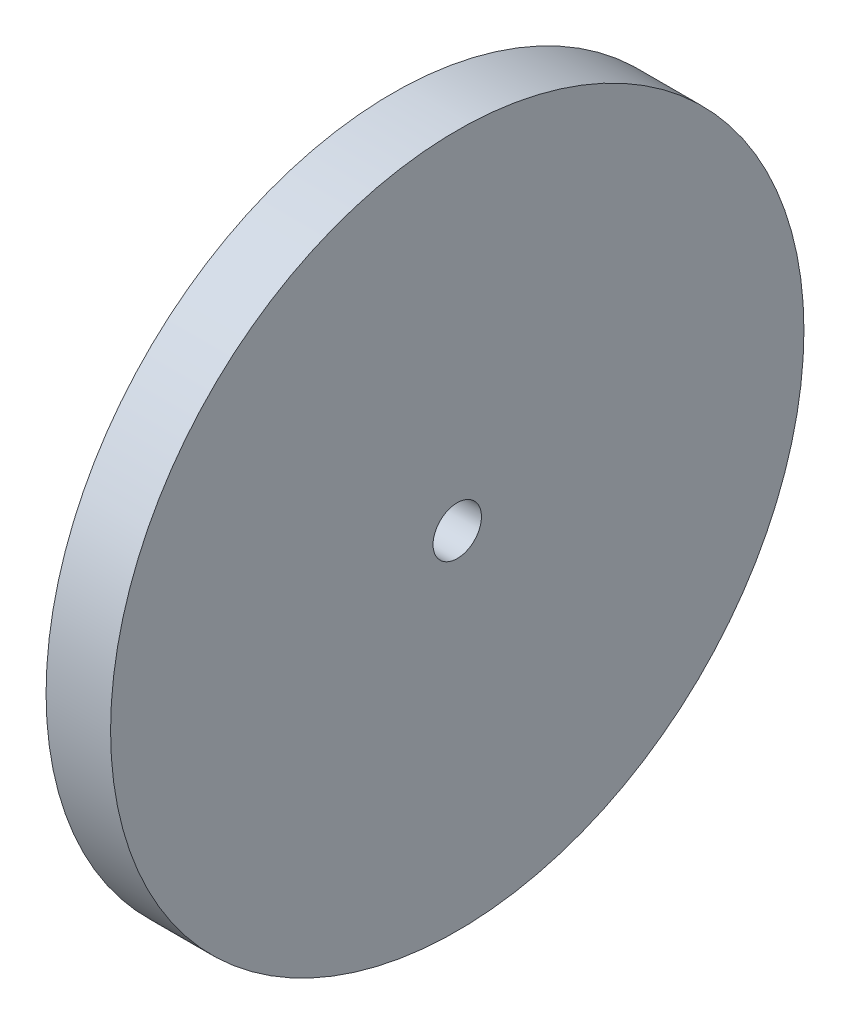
ISO-10303-21;
HEADER;
FILE_DESCRIPTION(('STEP AP214'),'2;1');
FILE_NAME('part.step','',(''),(''),'','','');
FILE_SCHEMA(('AUTOMOTIVE_DESIGN { 1 0 10303 214 1 1 1 1 }'));
ENDSEC;
DATA;
#1=APPLICATION_CONTEXT('core data for automotive mechanical design processes');
#2=APPLICATION_PROTOCOL_DEFINITION('international standard','automotive_design',2000,#1);
#3=PRODUCT_CONTEXT('',#1,'mechanical');
#4=PRODUCT('Part','Part','',(#3));
#5=PRODUCT_RELATED_PRODUCT_CATEGORY('part','',(#4));
#6=PRODUCT_DEFINITION_FORMATION('','',#4);
#7=PRODUCT_DEFINITION_CONTEXT('part definition',#1,'design');
#8=PRODUCT_DEFINITION('design','',#6,#7);
#9=PRODUCT_DEFINITION_SHAPE('','',#8);
#10=(LENGTH_UNIT() NAMED_UNIT(*) SI_UNIT(.MILLI.,.METRE.));
#11=(NAMED_UNIT(*) PLANE_ANGLE_UNIT() SI_UNIT($,.RADIAN.));
#12=(NAMED_UNIT(*) SI_UNIT($,.STERADIAN.) SOLID_ANGLE_UNIT());
#13=UNCERTAINTY_MEASURE_WITH_UNIT(LENGTH_MEASURE(1.E-05),#10,'distance_accuracy_value','');
#14=(GEOMETRIC_REPRESENTATION_CONTEXT(3) GLOBAL_UNCERTAINTY_ASSIGNED_CONTEXT((#13)) GLOBAL_UNIT_ASSIGNED_CONTEXT((#10,
#11,#12)) REPRESENTATION_CONTEXT('',''));
#15=CARTESIAN_POINT('',(0.,0.,0.));
#16=DIRECTION('',(0.,0.,1.));
#17=DIRECTION('',(1.,0.,0.));
#18=AXIS2_PLACEMENT_3D('',#15,#16,#17);
#19=CARTESIAN_POINT('',(0.,15.,0.));
#20=DIRECTION('',(1.,0.,0.));
#21=DIRECTION('',(0.,0.,-1.));
#22=AXIS2_PLACEMENT_3D('',#19,#20,#21);
#23=PLANE('',#22);
#24=CARTESIAN_POINT('',(0.,0.,0.));
#25=DIRECTION('',(-1.,0.,0.));
#26=DIRECTION('',(0.,0.,1.));
#27=AXIS2_PLACEMENT_3D('',#24,#25,#26);
#28=CIRCLE('',#27,15.);
#29=CARTESIAN_POINT('',(0.,0.,15.));
#30=VERTEX_POINT('',#29);
#31=EDGE_CURVE('E360',#30,#30,#28,.T.);
#32=ORIENTED_EDGE('',*,*,#31,.F.);
#33=EDGE_LOOP('',(#32));
#34=FACE_BOUND('',#33,.T.);
#35=CARTESIAN_POINT('',(0.,0.,0.));
#36=DIRECTION('',(-1.,0.,0.));
#37=DIRECTION('',(0.,0.,1.));
#38=AXIS2_PLACEMENT_3D('',#35,#36,#37);
#39=CIRCLE('',#38,215.);
#40=CARTESIAN_POINT('',(0.,0.,215.));
#41=VERTEX_POINT('',#40);
#42=EDGE_CURVE('E10',#41,#41,#39,.T.);
#43=ORIENTED_EDGE('',*,*,#42,.T.);
#44=EDGE_LOOP('',(#43));
#45=FACE_BOUND('',#44,.T.);
#46=ADVANCED_FACE('F346',(#34,#45),#23,.F.);
#47=CARTESIAN_POINT('',(0.,0.,0.));
#48=DIRECTION('',(-1.,0.,0.));
#49=DIRECTION('',(0.,0.,1.));
#50=AXIS2_PLACEMENT_3D('',#47,#48,#49);
#51=CYLINDRICAL_SURFACE('',#50,215.);
#52=ORIENTED_EDGE('',*,*,#42,.F.);
#53=EDGE_LOOP('',(#52));
#54=FACE_BOUND('',#53,.T.);
#55=CARTESIAN_POINT('',(40.,0.,0.));
#56=DIRECTION('',(-1.,0.,0.));
#57=DIRECTION('',(0.,0.,1.));
#58=AXIS2_PLACEMENT_3D('',#55,#56,#57);
#59=CIRCLE('',#58,215.);
#60=CARTESIAN_POINT('',(40.,0.,215.));
#61=VERTEX_POINT('',#60);
#62=EDGE_CURVE('E352',#61,#61,#59,.T.);
#63=ORIENTED_EDGE('',*,*,#62,.T.);
#64=EDGE_LOOP('',(#63));
#65=FACE_BOUND('',#64,.T.);
#66=ADVANCED_FACE('F369',(#54,#65),#51,.T.);
#67=CARTESIAN_POINT('',(40.,215.,0.));
#68=DIRECTION('',(-1.,0.,0.));
#69=DIRECTION('',(0.,0.,1.));
#70=AXIS2_PLACEMENT_3D('',#67,#68,#69);
#71=PLANE('',#70);
#72=ORIENTED_EDGE('',*,*,#62,.F.);
#73=EDGE_LOOP('',(#72));
#74=FACE_BOUND('',#73,.T.);
#75=CARTESIAN_POINT('',(40.,0.,0.));
#76=DIRECTION('',(-1.,0.,0.));
#77=DIRECTION('',(0.,0.,1.));
#78=AXIS2_PLACEMENT_3D('',#75,#76,#77);
#79=CIRCLE('',#78,15.);
#80=CARTESIAN_POINT('',(40.,0.,15.));
#81=VERTEX_POINT('',#80);
#82=EDGE_CURVE('E356',#81,#81,#79,.T.);
#83=ORIENTED_EDGE('',*,*,#82,.T.);
#84=EDGE_LOOP('',(#83));
#85=FACE_BOUND('',#84,.T.);
#86=ADVANCED_FACE('F373',(#74,#85),#71,.F.);
#87=CARTESIAN_POINT('',(0.,0.,0.));
#88=DIRECTION('',(-1.,0.,0.));
#89=DIRECTION('',(0.,0.,1.));
#90=AXIS2_PLACEMENT_3D('',#87,#88,#89);
#91=CYLINDRICAL_SURFACE('',#90,15.);
#92=ORIENTED_EDGE('',*,*,#82,.F.);
#93=EDGE_LOOP('',(#92));
#94=FACE_BOUND('',#93,.T.);
#95=ORIENTED_EDGE('',*,*,#31,.T.);
#96=EDGE_LOOP('',(#95));
#97=FACE_BOUND('',#96,.T.);
#98=ADVANCED_FACE('F366',(#94,#97),#91,.F.);
#99=CLOSED_SHELL('',(#46,#66,#86,#98));
#100=MANIFOLD_SOLID_BREP('B2',#99);
#101=ADVANCED_BREP_SHAPE_REPRESENTATION('',(#18,#100),#14);
#102=SHAPE_DEFINITION_REPRESENTATION(#9,#101);
ENDSEC;
END-ISO-10303-21;
